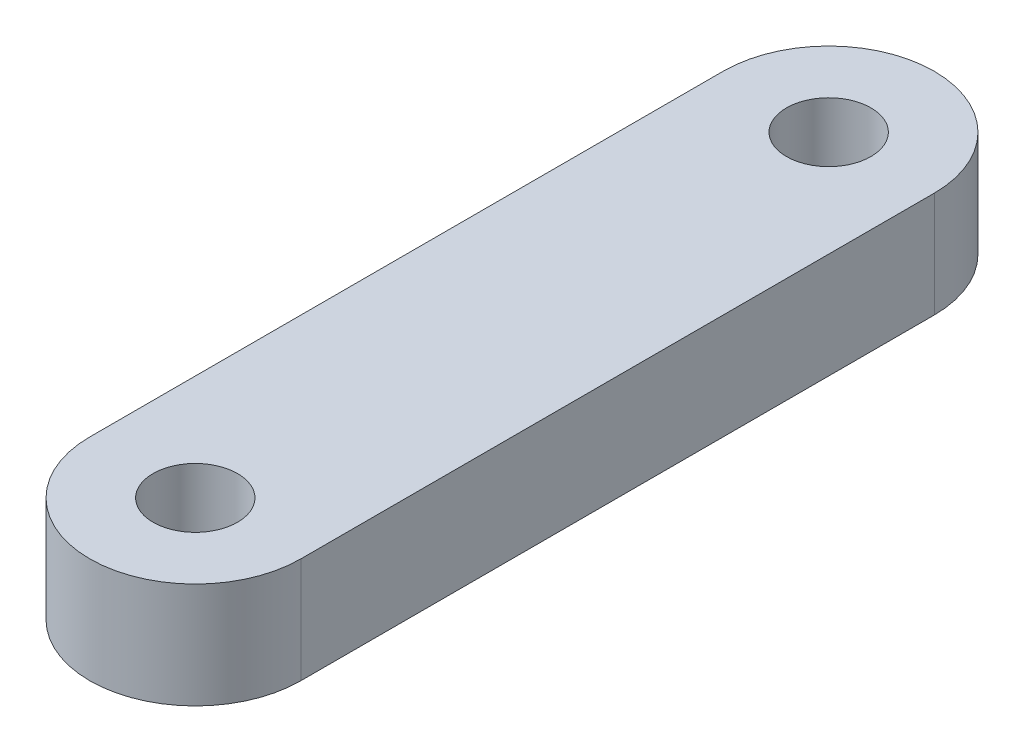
from build123d import *

# Parameters (mm, degrees)
SKETCH1_R           = 2
BOSS_EXTRUDE1_DEPTH = 5


with BuildPart() as part:
    # Sketch1 → Boss-Extrude1 (new body)
    with BuildSketch(Plane(origin=(0, 0, 0), x_dir=(1, 0, 0), z_dir=(0, 1, 0))):
        with BuildLine():
            Line((5, -15), (5, 15))
            ThreePointArc((5, 15), (0, 20), (-5, 15))
            Line((-5, 15), (-5, -15))
            ThreePointArc((-5, -15), (0, -20), (5, -15))
        make_face()
        with Locations(Location((0, 15, 0), (0, 0, 270))):
            Circle(SKETCH1_R, mode=Mode.SUBTRACT)
        with Locations(Location((0, -15, 0), (0, 0, 270))):
            Circle(SKETCH1_R, mode=Mode.SUBTRACT)
    extrude(amount=BOSS_EXTRUDE1_DEPTH)


solid = part.part
